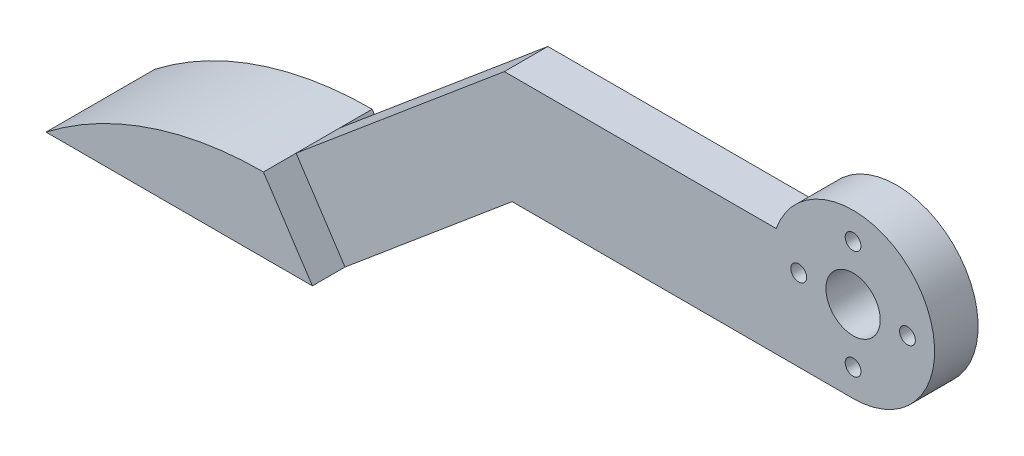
ISO-10303-21;
HEADER;
FILE_DESCRIPTION(('STEP AP214'),'2;1');
FILE_NAME('part.step','',(''),(''),'','','');
FILE_SCHEMA(('AUTOMOTIVE_DESIGN { 1 0 10303 214 1 1 1 1 }'));
ENDSEC;
DATA;
#1=APPLICATION_CONTEXT('core data for automotive mechanical design processes');
#2=APPLICATION_PROTOCOL_DEFINITION('international standard','automotive_design',2000,#1);
#3=PRODUCT_CONTEXT('',#1,'mechanical');
#4=PRODUCT('Part','Part','',(#3));
#5=PRODUCT_RELATED_PRODUCT_CATEGORY('part','',(#4));
#6=PRODUCT_DEFINITION_FORMATION('','',#4);
#7=PRODUCT_DEFINITION_CONTEXT('part definition',#1,'design');
#8=PRODUCT_DEFINITION('design','',#6,#7);
#9=PRODUCT_DEFINITION_SHAPE('','',#8);
#10=(LENGTH_UNIT() NAMED_UNIT(*) SI_UNIT(.MILLI.,.METRE.));
#11=(NAMED_UNIT(*) PLANE_ANGLE_UNIT() SI_UNIT($,.RADIAN.));
#12=(NAMED_UNIT(*) SI_UNIT($,.STERADIAN.) SOLID_ANGLE_UNIT());
#13=UNCERTAINTY_MEASURE_WITH_UNIT(LENGTH_MEASURE(1.E-05),#10,'distance_accuracy_value','');
#14=(GEOMETRIC_REPRESENTATION_CONTEXT(3) GLOBAL_UNCERTAINTY_ASSIGNED_CONTEXT((#13)) GLOBAL_UNIT_ASSIGNED_CONTEXT((#10,
#11,#12)) REPRESENTATION_CONTEXT('',''));
#15=CARTESIAN_POINT('',(0.,0.,0.));
#16=DIRECTION('',(0.,0.,1.));
#17=DIRECTION('',(1.,0.,0.));
#18=AXIS2_PLACEMENT_3D('',#15,#16,#17);
#19=CARTESIAN_POINT('',(0.,0.,8.));
#20=DIRECTION('',(0.,0.,1.));
#21=DIRECTION('',(1.,0.,0.));
#22=AXIS2_PLACEMENT_3D('',#19,#20,#21);
#23=PLANE('',#22);
#24=CARTESIAN_POINT('',(10.,0.,8.));
#25=DIRECTION('',(0.,0.,-1.));
#26=DIRECTION('',(-1.,0.,0.));
#27=AXIS2_PLACEMENT_3D('',#24,#25,#26);
#28=CIRCLE('',#27,1.45);
#29=CARTESIAN_POINT('',(8.55,0.,8.));
#30=VERTEX_POINT('',#29);
#31=EDGE_CURVE('E200',#30,#30,#28,.T.);
#32=ORIENTED_EDGE('',*,*,#31,.T.);
#33=EDGE_LOOP('',(#32));
#34=FACE_BOUND('',#33,.T.);
#35=CARTESIAN_POINT('',(-10.,0.,8.));
#36=DIRECTION('',(0.,0.,-1.));
#37=DIRECTION('',(-1.,0.,0.));
#38=AXIS2_PLACEMENT_3D('',#35,#36,#37);
#39=CIRCLE('',#38,1.45);
#40=CARTESIAN_POINT('',(-11.45,0.,8.));
#41=VERTEX_POINT('',#40);
#42=EDGE_CURVE('E210',#41,#41,#39,.T.);
#43=ORIENTED_EDGE('',*,*,#42,.T.);
#44=EDGE_LOOP('',(#43));
#45=FACE_BOUND('',#44,.T.);
#46=CARTESIAN_POINT('',(0.,-10.,8.));
#47=DIRECTION('',(0.,0.,-1.));
#48=DIRECTION('',(-1.,0.,0.));
#49=AXIS2_PLACEMENT_3D('',#46,#47,#48);
#50=CIRCLE('',#49,1.45);
#51=CARTESIAN_POINT('',(-1.45,-10.,8.));
#52=VERTEX_POINT('',#51);
#53=EDGE_CURVE('E216',#52,#52,#50,.T.);
#54=ORIENTED_EDGE('',*,*,#53,.T.);
#55=EDGE_LOOP('',(#54));
#56=FACE_BOUND('',#55,.T.);
#57=CARTESIAN_POINT('',(0.,10.,8.));
#58=DIRECTION('',(0.,0.,-1.));
#59=DIRECTION('',(-1.,0.,0.));
#60=AXIS2_PLACEMENT_3D('',#57,#58,#59);
#61=CIRCLE('',#60,1.45);
#62=CARTESIAN_POINT('',(-1.45,10.,8.));
#63=VERTEX_POINT('',#62);
#64=EDGE_CURVE('E192',#63,#63,#61,.T.);
#65=ORIENTED_EDGE('',*,*,#64,.T.);
#66=EDGE_LOOP('',(#65));
#67=FACE_BOUND('',#66,.T.);
#68=DIRECTION('',(0.766044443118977,0.64278760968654,0.));
#69=VECTOR('',#68,1.);
#70=CARTESIAN_POINT('',(-93.4443577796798,-40.789380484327,8.));
#71=LINE('',#70,#69);
#72=CARTESIAN_POINT('',(-93.4443577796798,-40.789380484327,8.));
#73=VERTEX_POINT('',#72);
#74=CARTESIAN_POINT('',(-62.7097709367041,-15.,8.));
#75=VERTEX_POINT('',#74);
#76=EDGE_CURVE('E133',#73,#75,#71,.T.);
#77=ORIENTED_EDGE('',*,*,#76,.T.);
#78=DIRECTION('',(1.,0.,0.));
#79=VECTOR('',#78,1.);
#80=CARTESIAN_POINT('',(0.,-15.,8.));
#81=LINE('',#80,#79);
#82=CARTESIAN_POINT('',(0.,-15.,8.));
#83=VERTEX_POINT('',#82);
#84=EDGE_CURVE('E90',#75,#83,#81,.T.);
#85=ORIENTED_EDGE('',*,*,#84,.T.);
#86=CARTESIAN_POINT('',(0.,0.,8.));
#87=DIRECTION('',(0.,0.,1.));
#88=DIRECTION('',(1.,0.,0.));
#89=AXIS2_PLACEMENT_3D('',#86,#87,#88);
#90=CIRCLE('',#89,15.);
#91=CARTESIAN_POINT('',(-14.142135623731,4.99999999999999,8.));
#92=VERTEX_POINT('',#91);
#93=EDGE_CURVE('E98',#83,#92,#90,.T.);
#94=ORIENTED_EDGE('',*,*,#93,.T.);
#95=DIRECTION('',(-1.,0.,0.));
#96=VECTOR('',#95,1.);
#97=CARTESIAN_POINT('',(-14.142135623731,5.,8.));
#98=LINE('',#97,#96);
#99=CARTESIAN_POINT('',(-64.142135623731,4.99999999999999,8.));
#100=VERTEX_POINT('',#99);
#101=EDGE_CURVE('E102',#92,#100,#98,.T.);
#102=ORIENTED_EDGE('',*,*,#101,.T.);
#103=DIRECTION('',(-0.766044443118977,-0.64278760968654,0.));
#104=VECTOR('',#103,1.);
#105=CARTESIAN_POINT('',(-64.142135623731,4.99999999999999,8.));
#106=LINE('',#105,#104);
#107=CARTESIAN_POINT('',(-102.44435777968,-27.139380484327,8.));
#108=VERTEX_POINT('',#107);
#109=EDGE_CURVE('E110',#100,#108,#106,.T.);
#110=ORIENTED_EDGE('',*,*,#109,.T.);
#111=DIRECTION('',(0.55045871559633,-0.834862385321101,0.));
#112=VECTOR('',#111,1.);
#113=CARTESIAN_POINT('',(-102.44435777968,-27.139380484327,8.));
#114=LINE('',#113,#112);
#115=EDGE_CURVE('E112',#108,#73,#114,.T.);
#116=ORIENTED_EDGE('',*,*,#115,.T.);
#117=EDGE_LOOP('',(#77,#85,#94,#102,#110,#116));
#118=FACE_BOUND('',#117,.T.);
#119=CARTESIAN_POINT('',(0.,0.,8.));
#120=DIRECTION('',(0.,0.,1.));
#121=DIRECTION('',(1.,0.,0.));
#122=AXIS2_PLACEMENT_3D('',#119,#120,#121);
#123=CIRCLE('',#122,5.);
#124=CARTESIAN_POINT('',(5.,0.,8.));
#125=VERTEX_POINT('',#124);
#126=EDGE_CURVE('E123',#125,#125,#123,.T.);
#127=ORIENTED_EDGE('',*,*,#126,.F.);
#128=EDGE_LOOP('',(#127));
#129=FACE_BOUND('',#128,.T.);
#130=ADVANCED_FACE('F39',(#34,#45,#56,#67,#118,#129),#23,.T.);
#131=CARTESIAN_POINT('',(0.,0.,0.));
#132=DIRECTION('',(0.,0.,1.));
#133=DIRECTION('',(1.,0.,0.));
#134=AXIS2_PLACEMENT_3D('',#131,#132,#133);
#135=PLANE('',#134);
#136=CARTESIAN_POINT('',(10.,0.,0.));
#137=DIRECTION('',(0.,0.,-1.));
#138=DIRECTION('',(-1.,0.,0.));
#139=AXIS2_PLACEMENT_3D('',#136,#137,#138);
#140=CIRCLE('',#139,1.45);
#141=CARTESIAN_POINT('',(8.55,0.,0.));
#142=VERTEX_POINT('',#141);
#143=EDGE_CURVE('E204',#142,#142,#140,.T.);
#144=ORIENTED_EDGE('',*,*,#143,.F.);
#145=EDGE_LOOP('',(#144));
#146=FACE_BOUND('',#145,.T.);
#147=CARTESIAN_POINT('',(-10.,0.,0.));
#148=DIRECTION('',(0.,0.,-1.));
#149=DIRECTION('',(-1.,0.,0.));
#150=AXIS2_PLACEMENT_3D('',#147,#148,#149);
#151=CIRCLE('',#150,1.45);
#152=CARTESIAN_POINT('',(-11.45,0.,0.));
#153=VERTEX_POINT('',#152);
#154=EDGE_CURVE('E207',#153,#153,#151,.T.);
#155=ORIENTED_EDGE('',*,*,#154,.F.);
#156=EDGE_LOOP('',(#155));
#157=FACE_BOUND('',#156,.T.);
#158=CARTESIAN_POINT('',(0.,-10.,0.));
#159=DIRECTION('',(0.,0.,-1.));
#160=DIRECTION('',(-1.,0.,0.));
#161=AXIS2_PLACEMENT_3D('',#158,#159,#160);
#162=CIRCLE('',#161,1.45);
#163=CARTESIAN_POINT('',(-1.45,-10.,0.));
#164=VERTEX_POINT('',#163);
#165=EDGE_CURVE('E213',#164,#164,#162,.T.);
#166=ORIENTED_EDGE('',*,*,#165,.F.);
#167=EDGE_LOOP('',(#166));
#168=FACE_BOUND('',#167,.T.);
#169=CARTESIAN_POINT('',(0.,10.,0.));
#170=DIRECTION('',(0.,0.,-1.));
#171=DIRECTION('',(-1.,0.,0.));
#172=AXIS2_PLACEMENT_3D('',#169,#170,#171);
#173=CIRCLE('',#172,1.45);
#174=CARTESIAN_POINT('',(-1.45,10.,0.));
#175=VERTEX_POINT('',#174);
#176=EDGE_CURVE('E195',#175,#175,#173,.T.);
#177=ORIENTED_EDGE('',*,*,#176,.F.);
#178=EDGE_LOOP('',(#177));
#179=FACE_BOUND('',#178,.T.);
#180=DIRECTION('',(0.766044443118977,0.64278760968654,0.));
#181=VECTOR('',#180,1.);
#182=CARTESIAN_POINT('',(-93.4443577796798,-40.789380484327,0.));
#183=LINE('',#182,#181);
#184=CARTESIAN_POINT('',(-93.4443577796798,-40.7893804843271,0.));
#185=VERTEX_POINT('',#184);
#186=CARTESIAN_POINT('',(-62.7097709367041,-15.,0.));
#187=VERTEX_POINT('',#186);
#188=EDGE_CURVE('E119',#185,#187,#183,.T.);
#189=ORIENTED_EDGE('',*,*,#188,.F.);
#190=DIRECTION('',(0.55045871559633,-0.834862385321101,0.));
#191=VECTOR('',#190,1.);
#192=CARTESIAN_POINT('',(-102.44435777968,-27.139380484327,0.));
#193=LINE('',#192,#191);
#194=CARTESIAN_POINT('',(-102.44435777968,-27.139380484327,0.));
#195=VERTEX_POINT('',#194);
#196=EDGE_CURVE('E130',#195,#185,#193,.T.);
#197=ORIENTED_EDGE('',*,*,#196,.F.);
#198=DIRECTION('',(-0.766044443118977,-0.64278760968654,0.));
#199=VECTOR('',#198,1.);
#200=CARTESIAN_POINT('',(-64.142135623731,4.99999999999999,0.));
#201=LINE('',#200,#199);
#202=CARTESIAN_POINT('',(-64.142135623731,4.99999999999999,0.));
#203=VERTEX_POINT('',#202);
#204=EDGE_CURVE('E127',#203,#195,#201,.T.);
#205=ORIENTED_EDGE('',*,*,#204,.F.);
#206=DIRECTION('',(-1.,0.,0.));
#207=VECTOR('',#206,1.);
#208=CARTESIAN_POINT('',(-14.142135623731,5.,0.));
#209=LINE('',#208,#207);
#210=CARTESIAN_POINT('',(-14.142135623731,4.99999999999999,0.));
#211=VERTEX_POINT('',#210);
#212=EDGE_CURVE('E82',#211,#203,#209,.T.);
#213=ORIENTED_EDGE('',*,*,#212,.F.);
#214=CARTESIAN_POINT('',(0.,0.,0.));
#215=DIRECTION('',(0.,0.,1.));
#216=DIRECTION('',(1.,0.,0.));
#217=AXIS2_PLACEMENT_3D('',#214,#215,#216);
#218=CIRCLE('',#217,15.);
#219=CARTESIAN_POINT('',(0.,-15.,0.));
#220=VERTEX_POINT('',#219);
#221=EDGE_CURVE('E75',#220,#211,#218,.T.);
#222=ORIENTED_EDGE('',*,*,#221,.F.);
#223=DIRECTION('',(1.,0.,0.));
#224=VECTOR('',#223,1.);
#225=CARTESIAN_POINT('',(0.,-15.,0.));
#226=LINE('',#225,#224);
#227=EDGE_CURVE('E122',#187,#220,#226,.T.);
#228=ORIENTED_EDGE('',*,*,#227,.F.);
#229=EDGE_LOOP('',(#189,#197,#205,#213,#222,#228));
#230=FACE_BOUND('',#229,.T.);
#231=CARTESIAN_POINT('',(0.,0.,0.));
#232=DIRECTION('',(0.,0.,1.));
#233=DIRECTION('',(1.,0.,0.));
#234=AXIS2_PLACEMENT_3D('',#231,#232,#233);
#235=CIRCLE('',#234,5.);
#236=CARTESIAN_POINT('',(5.,0.,0.));
#237=VERTEX_POINT('',#236);
#238=EDGE_CURVE('E203',#237,#237,#235,.T.);
#239=ORIENTED_EDGE('',*,*,#238,.T.);
#240=EDGE_LOOP('',(#239));
#241=FACE_BOUND('',#240,.T.);
#242=ADVANCED_FACE('F141',(#146,#157,#168,#179,#230,#241),#135,.F.);
#243=CARTESIAN_POINT('',(-93.4443577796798,-40.789380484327,8.));
#244=DIRECTION('',(-0.64278760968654,0.766044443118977,0.));
#245=DIRECTION('',(-0.766044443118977,-0.64278760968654,0.));
#246=AXIS2_PLACEMENT_3D('',#243,#244,#245);
#247=PLANE('',#246);
#248=ORIENTED_EDGE('',*,*,#188,.T.);
#249=DIRECTION('',(0.,0.,-1.));
#250=VECTOR('',#249,1.);
#251=CARTESIAN_POINT('',(-62.7097709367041,-15.,8.));
#252=LINE('',#251,#250);
#253=EDGE_CURVE('E11',#75,#187,#252,.T.);
#254=ORIENTED_EDGE('',*,*,#253,.F.);
#255=ORIENTED_EDGE('',*,*,#76,.F.);
#256=DIRECTION('',(0.,0.,-1.));
#257=VECTOR('',#256,1.);
#258=CARTESIAN_POINT('',(-93.4443577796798,-40.789380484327,8.));
#259=LINE('',#258,#257);
#260=EDGE_CURVE('E118',#73,#185,#259,.T.);
#261=ORIENTED_EDGE('',*,*,#260,.T.);
#262=EDGE_LOOP('',(#248,#254,#255,#261));
#263=FACE_BOUND('',#262,.T.);
#264=ADVANCED_FACE('F41',(#263),#247,.F.);
#265=CARTESIAN_POINT('',(0.,-15.,8.));
#266=DIRECTION('',(0.,1.,0.));
#267=DIRECTION('',(-1.,0.,0.));
#268=AXIS2_PLACEMENT_3D('',#265,#266,#267);
#269=PLANE('',#268);
#270=ORIENTED_EDGE('',*,*,#227,.T.);
#271=DIRECTION('',(0.,0.,-1.));
#272=VECTOR('',#271,1.);
#273=CARTESIAN_POINT('',(0.,-15.,8.));
#274=LINE('',#273,#272);
#275=EDGE_CURVE('E48',#83,#220,#274,.T.);
#276=ORIENTED_EDGE('',*,*,#275,.F.);
#277=ORIENTED_EDGE('',*,*,#84,.F.);
#278=ORIENTED_EDGE('',*,*,#253,.T.);
#279=EDGE_LOOP('',(#270,#276,#277,#278));
#280=FACE_BOUND('',#279,.T.);
#281=ADVANCED_FACE('F228',(#280),#269,.F.);
#282=CARTESIAN_POINT('',(0.,0.,8.));
#283=DIRECTION('',(0.,0.,-1.));
#284=DIRECTION('',(-1.,0.,0.));
#285=AXIS2_PLACEMENT_3D('',#282,#283,#284);
#286=CYLINDRICAL_SURFACE('',#285,15.);
#287=ORIENTED_EDGE('',*,*,#221,.T.);
#288=DIRECTION('',(0.,0.,-1.));
#289=VECTOR('',#288,1.);
#290=CARTESIAN_POINT('',(-14.142135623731,4.99999999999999,8.));
#291=LINE('',#290,#289);
#292=EDGE_CURVE('E104',#92,#211,#291,.T.);
#293=ORIENTED_EDGE('',*,*,#292,.F.);
#294=ORIENTED_EDGE('',*,*,#93,.F.);
#295=ORIENTED_EDGE('',*,*,#275,.T.);
#296=EDGE_LOOP('',(#287,#293,#294,#295));
#297=FACE_BOUND('',#296,.T.);
#298=ADVANCED_FACE('F105',(#297),#286,.T.);
#299=CARTESIAN_POINT('',(-14.142135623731,5.,8.));
#300=DIRECTION('',(0.,-1.,0.));
#301=DIRECTION('',(1.,0.,0.));
#302=AXIS2_PLACEMENT_3D('',#299,#300,#301);
#303=PLANE('',#302);
#304=ORIENTED_EDGE('',*,*,#212,.T.);
#305=DIRECTION('',(0.,0.,-1.));
#306=VECTOR('',#305,1.);
#307=CARTESIAN_POINT('',(-64.142135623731,4.99999999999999,8.));
#308=LINE('',#307,#306);
#309=EDGE_CURVE('E106',#100,#203,#308,.T.);
#310=ORIENTED_EDGE('',*,*,#309,.F.);
#311=ORIENTED_EDGE('',*,*,#101,.F.);
#312=ORIENTED_EDGE('',*,*,#292,.T.);
#313=EDGE_LOOP('',(#304,#310,#311,#312));
#314=FACE_BOUND('',#313,.T.);
#315=ADVANCED_FACE('F108',(#314),#303,.F.);
#316=CARTESIAN_POINT('',(-64.142135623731,4.99999999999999,8.));
#317=DIRECTION('',(0.64278760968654,-0.766044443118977,0.));
#318=DIRECTION('',(0.766044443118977,0.64278760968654,0.));
#319=AXIS2_PLACEMENT_3D('',#316,#317,#318);
#320=PLANE('',#319);
#321=ORIENTED_EDGE('',*,*,#204,.T.);
#322=DIRECTION('',(0.,0.,-1.));
#323=VECTOR('',#322,1.);
#324=CARTESIAN_POINT('',(-102.44435777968,-27.139380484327,8.));
#325=LINE('',#324,#323);
#326=EDGE_CURVE('E136',#108,#195,#325,.T.);
#327=ORIENTED_EDGE('',*,*,#326,.F.);
#328=ORIENTED_EDGE('',*,*,#109,.F.);
#329=ORIENTED_EDGE('',*,*,#309,.T.);
#330=EDGE_LOOP('',(#321,#327,#328,#329));
#331=FACE_BOUND('',#330,.T.);
#332=ADVANCED_FACE('F148',(#331),#320,.F.);
#333=CARTESIAN_POINT('',(0.,0.,8.));
#334=DIRECTION('',(0.,0.,-1.));
#335=DIRECTION('',(-1.,0.,0.));
#336=AXIS2_PLACEMENT_3D('',#333,#334,#335);
#337=CYLINDRICAL_SURFACE('',#336,5.);
#338=ORIENTED_EDGE('',*,*,#126,.T.);
#339=EDGE_LOOP('',(#338));
#340=FACE_BOUND('',#339,.T.);
#341=ORIENTED_EDGE('',*,*,#238,.F.);
#342=EDGE_LOOP('',(#341));
#343=FACE_BOUND('',#342,.T.);
#344=ADVANCED_FACE('F246',(#340,#343),#337,.F.);
#345=CARTESIAN_POINT('',(0.,10.,8.));
#346=DIRECTION('',(0.,0.,-1.));
#347=DIRECTION('',(-1.,0.,0.));
#348=AXIS2_PLACEMENT_3D('',#345,#346,#347);
#349=CYLINDRICAL_SURFACE('',#348,1.45);
#350=ORIENTED_EDGE('',*,*,#64,.F.);
#351=EDGE_LOOP('',(#350));
#352=FACE_BOUND('',#351,.T.);
#353=ORIENTED_EDGE('',*,*,#176,.T.);
#354=EDGE_LOOP('',(#353));
#355=FACE_BOUND('',#354,.T.);
#356=ADVANCED_FACE('F264',(#352,#355),#349,.F.);
#357=CARTESIAN_POINT('',(0.,-10.,8.));
#358=DIRECTION('',(0.,0.,-1.));
#359=DIRECTION('',(-1.,0.,0.));
#360=AXIS2_PLACEMENT_3D('',#357,#358,#359);
#361=CYLINDRICAL_SURFACE('',#360,1.45);
#362=ORIENTED_EDGE('',*,*,#53,.F.);
#363=EDGE_LOOP('',(#362));
#364=FACE_BOUND('',#363,.T.);
#365=ORIENTED_EDGE('',*,*,#165,.T.);
#366=EDGE_LOOP('',(#365));
#367=FACE_BOUND('',#366,.T.);
#368=ADVANCED_FACE('F272',(#364,#367),#361,.F.);
#369=CARTESIAN_POINT('',(-10.,0.,8.));
#370=DIRECTION('',(0.,0.,-1.));
#371=DIRECTION('',(-1.,0.,0.));
#372=AXIS2_PLACEMENT_3D('',#369,#370,#371);
#373=CYLINDRICAL_SURFACE('',#372,1.45);
#374=ORIENTED_EDGE('',*,*,#42,.F.);
#375=EDGE_LOOP('',(#374));
#376=FACE_BOUND('',#375,.T.);
#377=ORIENTED_EDGE('',*,*,#154,.T.);
#378=EDGE_LOOP('',(#377));
#379=FACE_BOUND('',#378,.T.);
#380=ADVANCED_FACE('F280',(#376,#379),#373,.F.);
#381=CARTESIAN_POINT('',(10.,0.,8.));
#382=DIRECTION('',(0.,0.,-1.));
#383=DIRECTION('',(-1.,0.,0.));
#384=AXIS2_PLACEMENT_3D('',#381,#382,#383);
#385=CYLINDRICAL_SURFACE('',#384,1.45);
#386=ORIENTED_EDGE('',*,*,#31,.F.);
#387=EDGE_LOOP('',(#386));
#388=FACE_BOUND('',#387,.T.);
#389=ORIENTED_EDGE('',*,*,#143,.T.);
#390=EDGE_LOOP('',(#389));
#391=FACE_BOUND('',#390,.T.);
#392=ADVANCED_FACE('F288',(#388,#391),#385,.F.);
#393=CARTESIAN_POINT('',(-93.4443577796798,-40.7893804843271,14.));
#394=DIRECTION('',(-0.834862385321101,-0.55045871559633,0.));
#395=DIRECTION('',(0.55045871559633,-0.834862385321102,0.));
#396=AXIS2_PLACEMENT_3D('',#393,#394,#395);
#397=PLANE('',#396);
#398=DIRECTION('',(0.,0.,-1.));
#399=VECTOR('',#398,1.);
#400=CARTESIAN_POINT('',(-102.44435777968,-27.139380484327,14.));
#401=LINE('',#400,#399);
#402=CARTESIAN_POINT('',(-102.44435777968,-27.139380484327,-6.));
#403=VERTEX_POINT('',#402);
#404=EDGE_CURVE('E154',#195,#403,#401,.T.);
#405=ORIENTED_EDGE('',*,*,#404,.F.);
#406=ORIENTED_EDGE('',*,*,#196,.T.);
#407=DIRECTION('',(0.,0.,-1.));
#408=VECTOR('',#407,1.);
#409=CARTESIAN_POINT('',(-93.4443577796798,-40.7893804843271,14.));
#410=LINE('',#409,#408);
#411=CARTESIAN_POINT('',(-93.4443577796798,-40.7893804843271,-6.));
#412=VERTEX_POINT('',#411);
#413=EDGE_CURVE('E364',#185,#412,#410,.T.);
#414=ORIENTED_EDGE('',*,*,#413,.T.);
#415=DIRECTION('',(-0.55045871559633,0.834862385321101,0.));
#416=VECTOR('',#415,1.);
#417=CARTESIAN_POINT('',(-93.4443577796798,-40.7893804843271,-6.));
#418=LINE('',#417,#416);
#419=EDGE_CURVE('E357',#412,#403,#418,.T.);
#420=ORIENTED_EDGE('',*,*,#419,.T.);
#421=EDGE_LOOP('',(#405,#406,#414,#420));
#422=FACE_BOUND('',#421,.T.);
#423=ADVANCED_FACE('F296',(#422),#397,.F.);
#424=ORIENTED_EDGE('',*,*,#115,.F.);
#425=CARTESIAN_POINT('',(-102.44435777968,-27.139380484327,14.));
#426=VERTEX_POINT('',#425);
#427=EDGE_CURVE('E180',#426,#108,#401,.T.);
#428=ORIENTED_EDGE('',*,*,#427,.F.);
#429=DIRECTION('',(-0.55045871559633,0.834862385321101,0.));
#430=VECTOR('',#429,1.);
#431=CARTESIAN_POINT('',(-93.4443577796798,-40.7893804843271,14.));
#432=LINE('',#431,#430);
#433=CARTESIAN_POINT('',(-93.4443577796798,-40.7893804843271,14.));
#434=VERTEX_POINT('',#433);
#435=EDGE_CURVE('E186',#434,#426,#432,.T.);
#436=ORIENTED_EDGE('',*,*,#435,.F.);
#437=EDGE_CURVE('E56',#434,#73,#410,.T.);
#438=ORIENTED_EDGE('',*,*,#437,.T.);
#439=EDGE_LOOP('',(#424,#428,#436,#438));
#440=FACE_BOUND('',#439,.T.);
#441=ADVANCED_FACE('F191',(#440),#397,.F.);
#442=CARTESIAN_POINT('',(-102.44435777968,-92.5724390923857,14.));
#443=DIRECTION('',(0.,0.,-1.));
#444=DIRECTION('',(-1.,0.,0.));
#445=AXIS2_PLACEMENT_3D('',#442,#443,#444);
#446=CYLINDRICAL_SURFACE('',#445,65.4330586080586);
#447=CARTESIAN_POINT('',(-102.44435777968,-92.5724390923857,-6.));
#448=DIRECTION('',(0.,0.,1.));
#449=DIRECTION('',(1.,0.,0.));
#450=AXIS2_PLACEMENT_3D('',#447,#448,#449);
#451=CIRCLE('',#450,65.4330586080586);
#452=CARTESIAN_POINT('',(-142.44435777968,-40.7893804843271,-6.));
#453=VERTEX_POINT('',#452);
#454=EDGE_CURVE('E359',#403,#453,#451,.T.);
#455=ORIENTED_EDGE('',*,*,#454,.T.);
#456=DIRECTION('',(0.,0.,-1.));
#457=VECTOR('',#456,1.);
#458=CARTESIAN_POINT('',(-142.44435777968,-40.7893804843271,14.));
#459=LINE('',#458,#457);
#460=CARTESIAN_POINT('',(-142.44435777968,-40.7893804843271,14.));
#461=VERTEX_POINT('',#460);
#462=EDGE_CURVE('E182',#461,#453,#459,.T.);
#463=ORIENTED_EDGE('',*,*,#462,.F.);
#464=CARTESIAN_POINT('',(-102.44435777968,-92.5724390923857,14.));
#465=DIRECTION('',(0.,0.,1.));
#466=DIRECTION('',(1.,0.,0.));
#467=AXIS2_PLACEMENT_3D('',#464,#465,#466);
#468=CIRCLE('',#467,65.4330586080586);
#469=EDGE_CURVE('E176',#426,#461,#468,.T.);
#470=ORIENTED_EDGE('',*,*,#469,.F.);
#471=ORIENTED_EDGE('',*,*,#427,.T.);
#472=ORIENTED_EDGE('',*,*,#326,.T.);
#473=ORIENTED_EDGE('',*,*,#404,.T.);
#474=EDGE_LOOP('',(#455,#463,#470,#471,#472,#473));
#475=FACE_BOUND('',#474,.T.);
#476=ADVANCED_FACE('F178',(#475),#446,.T.);
#477=CARTESIAN_POINT('',(-142.44435777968,-40.7893804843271,14.));
#478=DIRECTION('',(0.,1.,0.));
#479=DIRECTION('',(0.,0.,1.));
#480=AXIS2_PLACEMENT_3D('',#477,#478,#479);
#481=PLANE('',#480);
#482=DIRECTION('',(1.,0.,0.));
#483=VECTOR('',#482,1.);
#484=CARTESIAN_POINT('',(-142.44435777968,-40.7893804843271,-6.));
#485=LINE('',#484,#483);
#486=EDGE_CURVE('E189',#453,#412,#485,.T.);
#487=ORIENTED_EDGE('',*,*,#486,.T.);
#488=ORIENTED_EDGE('',*,*,#413,.F.);
#489=ORIENTED_EDGE('',*,*,#260,.F.);
#490=ORIENTED_EDGE('',*,*,#437,.F.);
#491=DIRECTION('',(1.,0.,0.));
#492=VECTOR('',#491,1.);
#493=CARTESIAN_POINT('',(-142.44435777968,-40.7893804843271,14.));
#494=LINE('',#493,#492);
#495=EDGE_CURVE('E185',#461,#434,#494,.T.);
#496=ORIENTED_EDGE('',*,*,#495,.F.);
#497=ORIENTED_EDGE('',*,*,#462,.T.);
#498=EDGE_LOOP('',(#487,#488,#489,#490,#496,#497));
#499=FACE_BOUND('',#498,.T.);
#500=ADVANCED_FACE('F324',(#499),#481,.F.);
#501=CARTESIAN_POINT('',(-102.44435777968,-92.5724390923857,14.));
#502=DIRECTION('',(0.,0.,1.));
#503=DIRECTION('',(1.,0.,0.));
#504=AXIS2_PLACEMENT_3D('',#501,#502,#503);
#505=PLANE('',#504);
#506=ORIENTED_EDGE('',*,*,#435,.T.);
#507=ORIENTED_EDGE('',*,*,#469,.T.);
#508=ORIENTED_EDGE('',*,*,#495,.T.);
#509=EDGE_LOOP('',(#506,#507,#508));
#510=FACE_BOUND('',#509,.T.);
#511=ADVANCED_FACE('F188',(#510),#505,.T.);
#512=CARTESIAN_POINT('',(-102.44435777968,-92.5724390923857,-6.));
#513=DIRECTION('',(0.,0.,1.));
#514=DIRECTION('',(1.,0.,0.));
#515=AXIS2_PLACEMENT_3D('',#512,#513,#514);
#516=PLANE('',#515);
#517=ORIENTED_EDGE('',*,*,#419,.F.);
#518=ORIENTED_EDGE('',*,*,#486,.F.);
#519=ORIENTED_EDGE('',*,*,#454,.F.);
#520=EDGE_LOOP('',(#517,#518,#519));
#521=FACE_BOUND('',#520,.T.);
#522=ADVANCED_FACE('F342',(#521),#516,.F.);
#523=CLOSED_SHELL('',(#130,#242,#264,#281,#298,#315,#332,#344,#356,#368,#380,#392,#423,#441,
#476,#500,#511,#522));
#524=MANIFOLD_SOLID_BREP('B2',#523);
#525=ADVANCED_BREP_SHAPE_REPRESENTATION('',(#18,#524),#14);
#526=SHAPE_DEFINITION_REPRESENTATION(#9,#525);
ENDSEC;
END-ISO-10303-21;
